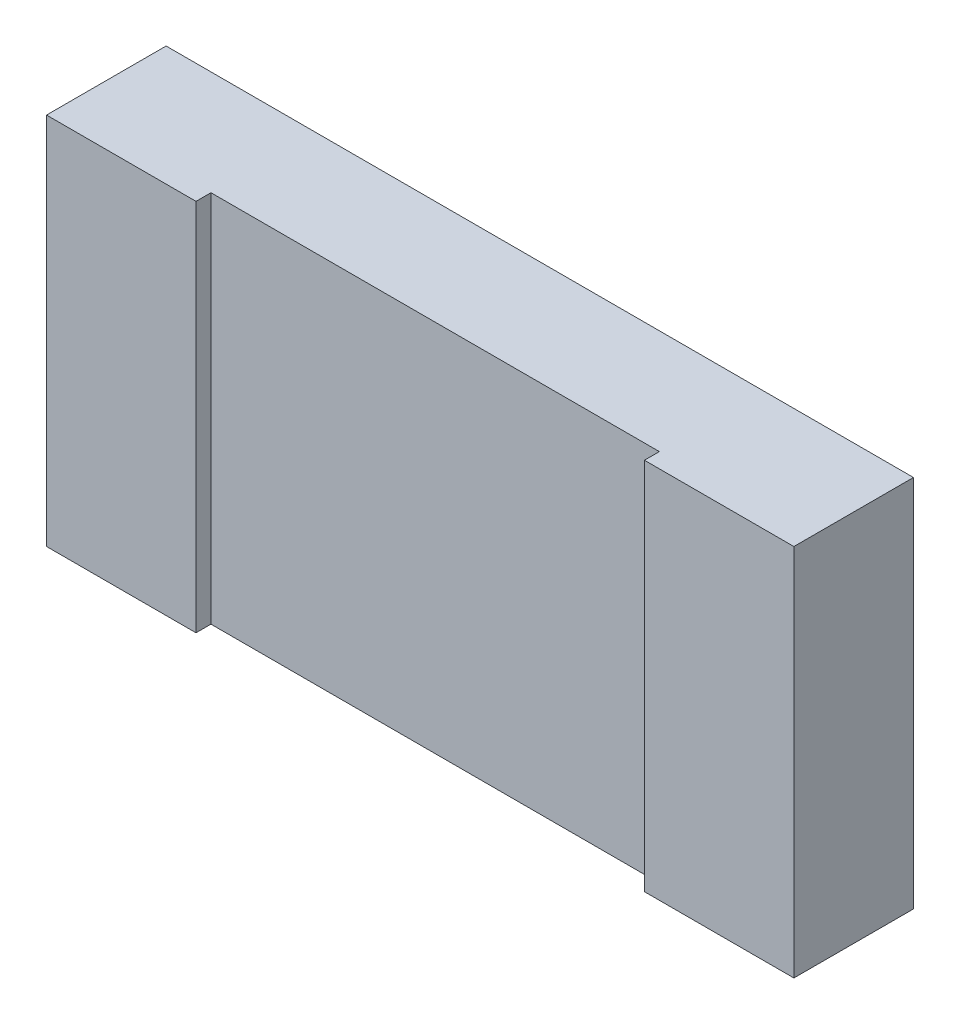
from build123d import *

# Parameters (mm, degrees)
SKETCH1_W          = 2.5
SKETCH1_H          = 1.25
BASE_EXTRUDE_DEPTH = 0.4
SKETCH2_W          = 1.5
SKETCH2_H          = 0.3
CUT_EXTRUDE1_DEPTH = 6.5


with BuildPart() as part:
    # Sketch1 → Base-Extrude (new body)
    with BuildSketch(Plane.XY):
        with Locations((1.25, 0.625)):
            Rectangle(SKETCH1_W, SKETCH1_H)
    extrude(amount=BASE_EXTRUDE_DEPTH)

    # Sketch2 → Cut-Extrude1 (cut)
    with BuildSketch(Plane(origin=(0, 0, 0), x_dir=(1, 0, 0), z_dir=(0, 1, 0))):
        with Locations((1.25, -0.5)):
            Rectangle(SKETCH2_W, SKETCH2_H)
    extrude(amount=CUT_EXTRUDE1_DEPTH, mode=Mode.SUBTRACT)


solid = part.part
